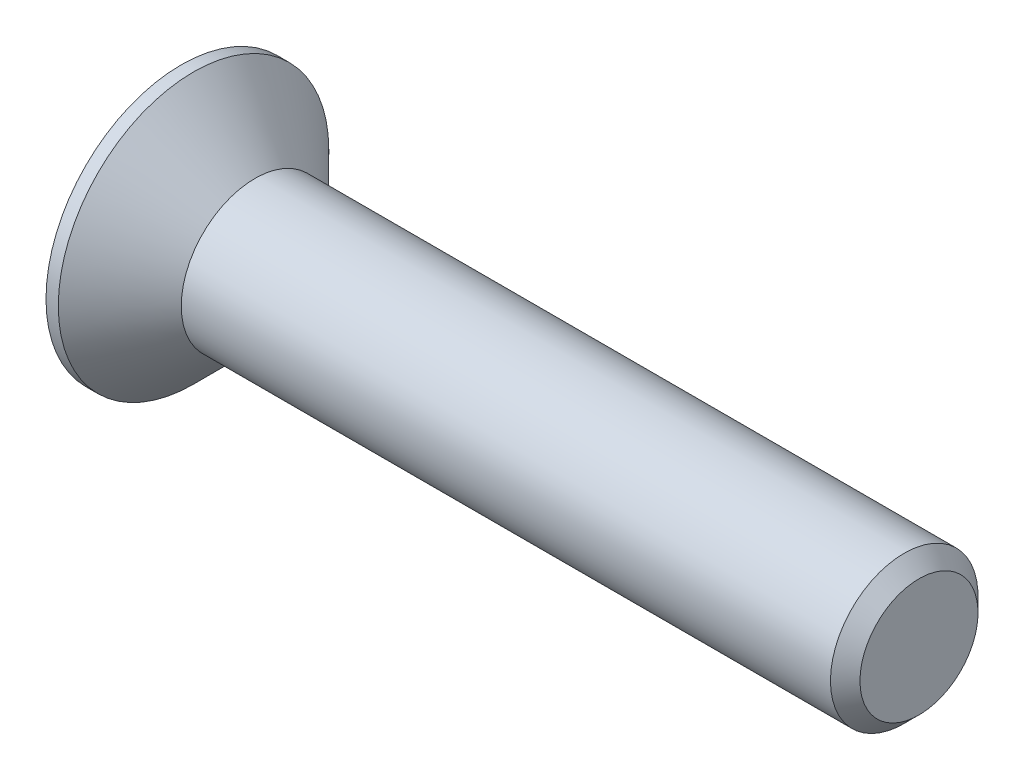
ISO-10303-21;
HEADER;
FILE_DESCRIPTION(('STEP AP214'),'2;1');
FILE_NAME('part.step','',(''),(''),'','','');
FILE_SCHEMA(('AUTOMOTIVE_DESIGN { 1 0 10303 214 1 1 1 1 }'));
ENDSEC;
DATA;
#1=APPLICATION_CONTEXT('core data for automotive mechanical design processes');
#2=APPLICATION_PROTOCOL_DEFINITION('international standard','automotive_design',2000,#1);
#3=PRODUCT_CONTEXT('',#1,'mechanical');
#4=PRODUCT('Part','Part','',(#3));
#5=PRODUCT_RELATED_PRODUCT_CATEGORY('part','',(#4));
#6=PRODUCT_DEFINITION_FORMATION('','',#4);
#7=PRODUCT_DEFINITION_CONTEXT('part definition',#1,'design');
#8=PRODUCT_DEFINITION('design','',#6,#7);
#9=PRODUCT_DEFINITION_SHAPE('','',#8);
#10=(LENGTH_UNIT() NAMED_UNIT(*) SI_UNIT(.MILLI.,.METRE.));
#11=(NAMED_UNIT(*) PLANE_ANGLE_UNIT() SI_UNIT($,.RADIAN.));
#12=(NAMED_UNIT(*) SI_UNIT($,.STERADIAN.) SOLID_ANGLE_UNIT());
#13=UNCERTAINTY_MEASURE_WITH_UNIT(LENGTH_MEASURE(1.E-05),#10,'distance_accuracy_value','');
#14=(GEOMETRIC_REPRESENTATION_CONTEXT(3) GLOBAL_UNCERTAINTY_ASSIGNED_CONTEXT((#13)) GLOBAL_UNIT_ASSIGNED_CONTEXT((#10,
#11,#12)) REPRESENTATION_CONTEXT('',''));
#15=CARTESIAN_POINT('',(0.,0.,0.));
#16=DIRECTION('',(0.,0.,1.));
#17=DIRECTION('',(1.,0.,0.));
#18=AXIS2_PLACEMENT_3D('',#15,#16,#17);
#19=CARTESIAN_POINT('',(0.,0.,0.));
#20=DIRECTION('',(-1.,0.,0.));
#21=DIRECTION('',(0.,0.,1.));
#22=AXIS2_PLACEMENT_3D('',#19,#20,#21);
#23=CONICAL_SURFACE('',#22,3.,0.78539816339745);
#24=CARTESIAN_POINT('',(-2.49999999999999,0.,0.));
#25=DIRECTION('',(-1.,0.,0.));
#26=DIRECTION('',(0.,0.,1.));
#27=AXIS2_PLACEMENT_3D('',#24,#25,#26);
#28=CIRCLE('',#27,5.5);
#29=CARTESIAN_POINT('',(-2.49999999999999,0.,5.5));
#30=VERTEX_POINT('',#29);
#31=EDGE_CURVE('E189',#30,#30,#28,.T.);
#32=ORIENTED_EDGE('',*,*,#31,.F.);
#33=EDGE_LOOP('',(#32));
#34=FACE_BOUND('',#33,.T.);
#35=CARTESIAN_POINT('',(0.,0.,0.));
#36=DIRECTION('',(-1.,0.,0.));
#37=DIRECTION('',(0.,0.,1.));
#38=AXIS2_PLACEMENT_3D('',#35,#36,#37);
#39=CIRCLE('',#38,3.);
#40=CARTESIAN_POINT('',(0.,0.,3.));
#41=VERTEX_POINT('',#40);
#42=EDGE_CURVE('E212',#41,#41,#39,.T.);
#43=ORIENTED_EDGE('',*,*,#42,.T.);
#44=EDGE_LOOP('',(#43));
#45=FACE_BOUND('',#44,.T.);
#46=ADVANCED_FACE('F33',(#34,#45),#23,.T.);
#47=CARTESIAN_POINT('',(-3.,0.,0.));
#48=DIRECTION('',(-1.,0.,0.));
#49=DIRECTION('',(0.,0.,1.));
#50=AXIS2_PLACEMENT_3D('',#47,#48,#49);
#51=CYLINDRICAL_SURFACE('',#50,3.);
#52=CARTESIAN_POINT('',(26.4,0.,0.));
#53=DIRECTION('',(-1.,0.,0.));
#54=DIRECTION('',(0.,0.,1.));
#55=AXIS2_PLACEMENT_3D('',#52,#53,#54);
#56=CIRCLE('',#55,3.);
#57=CARTESIAN_POINT('',(26.4,0.,3.));
#58=VERTEX_POINT('',#57);
#59=EDGE_CURVE('E41',#58,#58,#56,.T.);
#60=ORIENTED_EDGE('',*,*,#59,.T.);
#61=EDGE_LOOP('',(#60));
#62=FACE_BOUND('',#61,.T.);
#63=ORIENTED_EDGE('',*,*,#42,.F.);
#64=EDGE_LOOP('',(#63));
#65=FACE_BOUND('',#64,.T.);
#66=ADVANCED_FACE('F217',(#62,#65),#51,.T.);
#67=CARTESIAN_POINT('',(27.,0.,0.));
#68=DIRECTION('',(-1.,0.,0.));
#69=DIRECTION('',(0.,0.,1.));
#70=AXIS2_PLACEMENT_3D('',#67,#68,#69);
#71=PLANE('',#70);
#72=CARTESIAN_POINT('',(27.,0.,0.));
#73=DIRECTION('',(-1.,0.,0.));
#74=DIRECTION('',(0.,0.,1.));
#75=AXIS2_PLACEMENT_3D('',#72,#73,#74);
#76=CIRCLE('',#75,2.4);
#77=CARTESIAN_POINT('',(27.,0.,2.4));
#78=VERTEX_POINT('',#77);
#79=EDGE_CURVE('E11',#78,#78,#76,.F.);
#80=ORIENTED_EDGE('',*,*,#79,.T.);
#81=EDGE_LOOP('',(#80));
#82=FACE_BOUND('',#81,.T.);
#83=ADVANCED_FACE('F239',(#82),#71,.F.);
#84=CARTESIAN_POINT('',(-3.,5.5,0.));
#85=DIRECTION('',(1.,0.,0.));
#86=DIRECTION('',(0.,0.,-1.));
#87=AXIS2_PLACEMENT_3D('',#84,#85,#86);
#88=PLANE('',#87);
#89=DIRECTION('',(0.,0.,-1.));
#90=VECTOR('',#89,1.);
#91=CARTESIAN_POINT('',(-3.,0.825,-3.3));
#92=LINE('',#91,#90);
#93=CARTESIAN_POINT('',(-3.,0.825,-0.825));
#94=VERTEX_POINT('',#93);
#95=CARTESIAN_POINT('',(-3.,0.825,-3.3));
#96=VERTEX_POINT('',#95);
#97=EDGE_CURVE('E158',#94,#96,#92,.T.);
#98=ORIENTED_EDGE('',*,*,#97,.F.);
#99=DIRECTION('',(0.,-1.,0.));
#100=VECTOR('',#99,1.);
#101=CARTESIAN_POINT('',(-3.,0.825,-0.825));
#102=LINE('',#101,#100);
#103=CARTESIAN_POINT('',(-3.,3.3,-0.825));
#104=VERTEX_POINT('',#103);
#105=EDGE_CURVE('E48',#104,#94,#102,.T.);
#106=ORIENTED_EDGE('',*,*,#105,.F.);
#107=DIRECTION('',(0.,0.,-1.));
#108=VECTOR('',#107,1.);
#109=CARTESIAN_POINT('',(-3.,3.3,-0.825));
#110=LINE('',#109,#108);
#111=CARTESIAN_POINT('',(-3.,3.3,0.825));
#112=VERTEX_POINT('',#111);
#113=EDGE_CURVE('E185',#112,#104,#110,.T.);
#114=ORIENTED_EDGE('',*,*,#113,.F.);
#115=DIRECTION('',(0.,1.,0.));
#116=VECTOR('',#115,1.);
#117=CARTESIAN_POINT('',(-3.,3.3,0.825));
#118=LINE('',#117,#116);
#119=CARTESIAN_POINT('',(-3.,0.825,0.825));
#120=VERTEX_POINT('',#119);
#121=EDGE_CURVE('E183',#120,#112,#118,.T.);
#122=ORIENTED_EDGE('',*,*,#121,.F.);
#123=DIRECTION('',(0.,0.,-1.));
#124=VECTOR('',#123,1.);
#125=CARTESIAN_POINT('',(-3.,0.825,0.825));
#126=LINE('',#125,#124);
#127=CARTESIAN_POINT('',(-3.,0.825,3.3));
#128=VERTEX_POINT('',#127);
#129=EDGE_CURVE('E132',#128,#120,#126,.T.);
#130=ORIENTED_EDGE('',*,*,#129,.F.);
#131=DIRECTION('',(0.,1.,0.));
#132=VECTOR('',#131,1.);
#133=CARTESIAN_POINT('',(-3.,0.825,3.3));
#134=LINE('',#133,#132);
#135=CARTESIAN_POINT('',(-3.,-0.825,3.3));
#136=VERTEX_POINT('',#135);
#137=EDGE_CURVE('E179',#136,#128,#134,.T.);
#138=ORIENTED_EDGE('',*,*,#137,.F.);
#139=DIRECTION('',(0.,0.,1.));
#140=VECTOR('',#139,1.);
#141=CARTESIAN_POINT('',(-3.,-0.825,3.3));
#142=LINE('',#141,#140);
#143=CARTESIAN_POINT('',(-3.,-0.825,0.825));
#144=VERTEX_POINT('',#143);
#145=EDGE_CURVE('E176',#144,#136,#142,.T.);
#146=ORIENTED_EDGE('',*,*,#145,.F.);
#147=DIRECTION('',(0.,1.,0.));
#148=VECTOR('',#147,1.);
#149=CARTESIAN_POINT('',(-3.,-0.825,0.825));
#150=LINE('',#149,#148);
#151=CARTESIAN_POINT('',(-3.,-3.3,0.825));
#152=VERTEX_POINT('',#151);
#153=EDGE_CURVE('E173',#152,#144,#150,.T.);
#154=ORIENTED_EDGE('',*,*,#153,.F.);
#155=DIRECTION('',(0.,0.,1.));
#156=VECTOR('',#155,1.);
#157=CARTESIAN_POINT('',(-3.,-3.3,0.825));
#158=LINE('',#157,#156);
#159=CARTESIAN_POINT('',(-3.,-3.3,-0.825));
#160=VERTEX_POINT('',#159);
#161=EDGE_CURVE('E170',#160,#152,#158,.T.);
#162=ORIENTED_EDGE('',*,*,#161,.F.);
#163=DIRECTION('',(0.,-1.,0.));
#164=VECTOR('',#163,1.);
#165=CARTESIAN_POINT('',(-3.,-3.3,-0.825));
#166=LINE('',#165,#164);
#167=CARTESIAN_POINT('',(-3.,-0.825,-0.825));
#168=VERTEX_POINT('',#167);
#169=EDGE_CURVE('E167',#168,#160,#166,.T.);
#170=ORIENTED_EDGE('',*,*,#169,.F.);
#171=DIRECTION('',(0.,0.,1.));
#172=VECTOR('',#171,1.);
#173=CARTESIAN_POINT('',(-3.,-0.825,-0.825));
#174=LINE('',#173,#172);
#175=CARTESIAN_POINT('',(-3.,-0.825,-3.3));
#176=VERTEX_POINT('',#175);
#177=EDGE_CURVE('E164',#176,#168,#174,.T.);
#178=ORIENTED_EDGE('',*,*,#177,.F.);
#179=DIRECTION('',(0.,-1.,0.));
#180=VECTOR('',#179,1.);
#181=CARTESIAN_POINT('',(-3.,-0.825,-3.3));
#182=LINE('',#181,#180);
#183=EDGE_CURVE('E161',#96,#176,#182,.T.);
#184=ORIENTED_EDGE('',*,*,#183,.F.);
#185=EDGE_LOOP('',(#98,#106,#114,#122,#130,#138,#146,#154,#162,#170,#178,#184));
#186=FACE_BOUND('',#185,.T.);
#187=CARTESIAN_POINT('',(-3.,0.,0.));
#188=DIRECTION('',(-1.,0.,0.));
#189=DIRECTION('',(0.,0.,1.));
#190=AXIS2_PLACEMENT_3D('',#187,#188,#189);
#191=CIRCLE('',#190,5.5);
#192=CARTESIAN_POINT('',(-3.,0.,5.5));
#193=VERTEX_POINT('',#192);
#194=EDGE_CURVE('E209',#193,#193,#191,.T.);
#195=ORIENTED_EDGE('',*,*,#194,.T.);
#196=EDGE_LOOP('',(#195));
#197=FACE_BOUND('',#196,.T.);
#198=ADVANCED_FACE('F230',(#186,#197),#88,.F.);
#199=CARTESIAN_POINT('',(-3.,0.,0.));
#200=DIRECTION('',(-1.,0.,0.));
#201=DIRECTION('',(0.,0.,1.));
#202=AXIS2_PLACEMENT_3D('',#199,#200,#201);
#203=CYLINDRICAL_SURFACE('',#202,5.5);
#204=ORIENTED_EDGE('',*,*,#194,.F.);
#205=EDGE_LOOP('',(#204));
#206=FACE_BOUND('',#205,.T.);
#207=ORIENTED_EDGE('',*,*,#31,.T.);
#208=EDGE_LOOP('',(#207));
#209=FACE_BOUND('',#208,.T.);
#210=ADVANCED_FACE('F222',(#206,#209),#203,.T.);
#211=CARTESIAN_POINT('',(26.4,0.,0.));
#212=DIRECTION('',(-1.,0.,0.));
#213=DIRECTION('',(0.,0.,1.));
#214=AXIS2_PLACEMENT_3D('',#211,#212,#213);
#215=CONICAL_SURFACE('',#214,3.,0.785398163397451);
#216=ORIENTED_EDGE('',*,*,#79,.F.);
#217=EDGE_LOOP('',(#216));
#218=FACE_BOUND('',#217,.T.);
#219=ORIENTED_EDGE('',*,*,#59,.F.);
#220=EDGE_LOOP('',(#219));
#221=FACE_BOUND('',#220,.T.);
#222=ADVANCED_FACE('F35',(#218,#221),#215,.T.);
#223=CARTESIAN_POINT('',(-0.5,0.825,-0.825));
#224=DIRECTION('',(0.,0.,-1.));
#225=DIRECTION('',(-1.,0.,0.));
#226=AXIS2_PLACEMENT_3D('',#223,#224,#225);
#227=PLANE('',#226);
#228=ORIENTED_EDGE('',*,*,#105,.T.);
#229=DIRECTION('',(-1.,0.,0.));
#230=VECTOR('',#229,1.);
#231=CARTESIAN_POINT('',(-0.5,0.825,-0.825));
#232=LINE('',#231,#230);
#233=CARTESIAN_POINT('',(-0.5,0.825,-0.825));
#234=VERTEX_POINT('',#233);
#235=EDGE_CURVE('E96',#234,#94,#232,.T.);
#236=ORIENTED_EDGE('',*,*,#235,.F.);
#237=DIRECTION('',(0.,-1.,0.));
#238=VECTOR('',#237,1.);
#239=CARTESIAN_POINT('',(-0.5,0.825,-0.825));
#240=LINE('',#239,#238);
#241=CARTESIAN_POINT('',(-0.5,3.3,-0.825));
#242=VERTEX_POINT('',#241);
#243=EDGE_CURVE('E187',#242,#234,#240,.T.);
#244=ORIENTED_EDGE('',*,*,#243,.F.);
#245=DIRECTION('',(-1.,0.,0.));
#246=VECTOR('',#245,1.);
#247=CARTESIAN_POINT('',(-0.5,3.3,-0.825));
#248=LINE('',#247,#246);
#249=EDGE_CURVE('E56',#242,#104,#248,.T.);
#250=ORIENTED_EDGE('',*,*,#249,.T.);
#251=EDGE_LOOP('',(#228,#236,#244,#250));
#252=FACE_BOUND('',#251,.T.);
#253=ADVANCED_FACE('F221',(#252),#227,.F.);
#254=CARTESIAN_POINT('',(-0.5,3.3,-0.825));
#255=DIRECTION('',(0.,1.,0.));
#256=DIRECTION('',(-1.,0.,0.));
#257=AXIS2_PLACEMENT_3D('',#254,#255,#256);
#258=PLANE('',#257);
#259=ORIENTED_EDGE('',*,*,#113,.T.);
#260=ORIENTED_EDGE('',*,*,#249,.F.);
#261=DIRECTION('',(0.,0.,-1.));
#262=VECTOR('',#261,1.);
#263=CARTESIAN_POINT('',(-0.5,3.3,-0.825));
#264=LINE('',#263,#262);
#265=CARTESIAN_POINT('',(-0.5,3.3,0.825));
#266=VERTEX_POINT('',#265);
#267=EDGE_CURVE('E144',#266,#242,#264,.T.);
#268=ORIENTED_EDGE('',*,*,#267,.F.);
#269=DIRECTION('',(-1.,0.,0.));
#270=VECTOR('',#269,1.);
#271=CARTESIAN_POINT('',(-0.5,3.3,0.825));
#272=LINE('',#271,#270);
#273=EDGE_CURVE('E136',#266,#112,#272,.T.);
#274=ORIENTED_EDGE('',*,*,#273,.T.);
#275=EDGE_LOOP('',(#259,#260,#268,#274));
#276=FACE_BOUND('',#275,.T.);
#277=ADVANCED_FACE('F228',(#276),#258,.F.);
#278=CARTESIAN_POINT('',(-0.5,3.3,0.825));
#279=DIRECTION('',(0.,0.,1.));
#280=DIRECTION('',(1.,0.,0.));
#281=AXIS2_PLACEMENT_3D('',#278,#279,#280);
#282=PLANE('',#281);
#283=ORIENTED_EDGE('',*,*,#121,.T.);
#284=ORIENTED_EDGE('',*,*,#273,.F.);
#285=DIRECTION('',(0.,1.,0.));
#286=VECTOR('',#285,1.);
#287=CARTESIAN_POINT('',(-0.5,3.3,0.825));
#288=LINE('',#287,#286);
#289=CARTESIAN_POINT('',(-0.5,0.825,0.825));
#290=VERTEX_POINT('',#289);
#291=EDGE_CURVE('E140',#290,#266,#288,.T.);
#292=ORIENTED_EDGE('',*,*,#291,.F.);
#293=DIRECTION('',(-1.,0.,0.));
#294=VECTOR('',#293,1.);
#295=CARTESIAN_POINT('',(-0.5,0.825,0.825));
#296=LINE('',#295,#294);
#297=EDGE_CURVE('E125',#290,#120,#296,.T.);
#298=ORIENTED_EDGE('',*,*,#297,.T.);
#299=EDGE_LOOP('',(#283,#284,#292,#298));
#300=FACE_BOUND('',#299,.T.);
#301=ADVANCED_FACE('F141',(#300),#282,.F.);
#302=CARTESIAN_POINT('',(-0.5,0.825,0.825));
#303=DIRECTION('',(0.,1.,0.));
#304=DIRECTION('',(-1.,0.,0.));
#305=AXIS2_PLACEMENT_3D('',#302,#303,#304);
#306=PLANE('',#305);
#307=ORIENTED_EDGE('',*,*,#129,.T.);
#308=ORIENTED_EDGE('',*,*,#297,.F.);
#309=DIRECTION('',(0.,0.,-1.));
#310=VECTOR('',#309,1.);
#311=CARTESIAN_POINT('',(-0.5,0.825,0.825));
#312=LINE('',#311,#310);
#313=CARTESIAN_POINT('',(-0.5,0.825,3.3));
#314=VERTEX_POINT('',#313);
#315=EDGE_CURVE('E129',#314,#290,#312,.T.);
#316=ORIENTED_EDGE('',*,*,#315,.F.);
#317=DIRECTION('',(-1.,0.,0.));
#318=VECTOR('',#317,1.);
#319=CARTESIAN_POINT('',(-0.5,0.825,3.3));
#320=LINE('',#319,#318);
#321=EDGE_CURVE('E137',#314,#128,#320,.T.);
#322=ORIENTED_EDGE('',*,*,#321,.T.);
#323=EDGE_LOOP('',(#307,#308,#316,#322));
#324=FACE_BOUND('',#323,.T.);
#325=ADVANCED_FACE('F127',(#324),#306,.F.);
#326=CARTESIAN_POINT('',(-0.5,0.825,3.3));
#327=DIRECTION('',(0.,0.,1.));
#328=DIRECTION('',(1.,0.,0.));
#329=AXIS2_PLACEMENT_3D('',#326,#327,#328);
#330=PLANE('',#329);
#331=ORIENTED_EDGE('',*,*,#137,.T.);
#332=ORIENTED_EDGE('',*,*,#321,.F.);
#333=DIRECTION('',(0.,1.,0.));
#334=VECTOR('',#333,1.);
#335=CARTESIAN_POINT('',(-0.5,0.825,3.3));
#336=LINE('',#335,#334);
#337=CARTESIAN_POINT('',(-0.5,-0.825,3.3));
#338=VERTEX_POINT('',#337);
#339=EDGE_CURVE('E150',#338,#314,#336,.T.);
#340=ORIENTED_EDGE('',*,*,#339,.F.);
#341=DIRECTION('',(-1.,0.,0.));
#342=VECTOR('',#341,1.);
#343=CARTESIAN_POINT('',(-0.5,-0.825,3.3));
#344=LINE('',#343,#342);
#345=EDGE_CURVE('E192',#338,#136,#344,.T.);
#346=ORIENTED_EDGE('',*,*,#345,.T.);
#347=EDGE_LOOP('',(#331,#332,#340,#346));
#348=FACE_BOUND('',#347,.T.);
#349=ADVANCED_FACE('F277',(#348),#330,.F.);
#350=CARTESIAN_POINT('',(-0.5,-0.825,3.3));
#351=DIRECTION('',(0.,-1.,0.));
#352=DIRECTION('',(1.,0.,0.));
#353=AXIS2_PLACEMENT_3D('',#350,#351,#352);
#354=PLANE('',#353);
#355=ORIENTED_EDGE('',*,*,#145,.T.);
#356=ORIENTED_EDGE('',*,*,#345,.F.);
#357=DIRECTION('',(0.,0.,1.));
#358=VECTOR('',#357,1.);
#359=CARTESIAN_POINT('',(-0.5,-0.825,3.3));
#360=LINE('',#359,#358);
#361=CARTESIAN_POINT('',(-0.5,-0.825,0.825));
#362=VERTEX_POINT('',#361);
#363=EDGE_CURVE('E152',#362,#338,#360,.T.);
#364=ORIENTED_EDGE('',*,*,#363,.F.);
#365=DIRECTION('',(-1.,0.,0.));
#366=VECTOR('',#365,1.);
#367=CARTESIAN_POINT('',(-0.5,-0.825,0.825));
#368=LINE('',#367,#366);
#369=EDGE_CURVE('E194',#362,#144,#368,.T.);
#370=ORIENTED_EDGE('',*,*,#369,.T.);
#371=EDGE_LOOP('',(#355,#356,#364,#370));
#372=FACE_BOUND('',#371,.T.);
#373=ADVANCED_FACE('F273',(#372),#354,.F.);
#374=CARTESIAN_POINT('',(-0.5,-0.825,0.825));
#375=DIRECTION('',(0.,0.,1.));
#376=DIRECTION('',(1.,0.,0.));
#377=AXIS2_PLACEMENT_3D('',#374,#375,#376);
#378=PLANE('',#377);
#379=ORIENTED_EDGE('',*,*,#153,.T.);
#380=ORIENTED_EDGE('',*,*,#369,.F.);
#381=DIRECTION('',(0.,1.,0.));
#382=VECTOR('',#381,1.);
#383=CARTESIAN_POINT('',(-0.5,-0.825,0.825));
#384=LINE('',#383,#382);
#385=CARTESIAN_POINT('',(-0.5,-3.3,0.825));
#386=VERTEX_POINT('',#385);
#387=EDGE_CURVE('E422',#386,#362,#384,.T.);
#388=ORIENTED_EDGE('',*,*,#387,.F.);
#389=DIRECTION('',(-1.,0.,0.));
#390=VECTOR('',#389,1.);
#391=CARTESIAN_POINT('',(-0.5,-3.3,0.825));
#392=LINE('',#391,#390);
#393=EDGE_CURVE('E196',#386,#152,#392,.T.);
#394=ORIENTED_EDGE('',*,*,#393,.T.);
#395=EDGE_LOOP('',(#379,#380,#388,#394));
#396=FACE_BOUND('',#395,.T.);
#397=ADVANCED_FACE('F269',(#396),#378,.F.);
#398=CARTESIAN_POINT('',(-0.5,-3.3,0.825));
#399=DIRECTION('',(0.,-1.,0.));
#400=DIRECTION('',(1.,0.,0.));
#401=AXIS2_PLACEMENT_3D('',#398,#399,#400);
#402=PLANE('',#401);
#403=ORIENTED_EDGE('',*,*,#161,.T.);
#404=ORIENTED_EDGE('',*,*,#393,.F.);
#405=DIRECTION('',(0.,0.,1.));
#406=VECTOR('',#405,1.);
#407=CARTESIAN_POINT('',(-0.5,-3.3,0.825));
#408=LINE('',#407,#406);
#409=CARTESIAN_POINT('',(-0.5,-3.3,-0.825));
#410=VERTEX_POINT('',#409);
#411=EDGE_CURVE('E419',#410,#386,#408,.T.);
#412=ORIENTED_EDGE('',*,*,#411,.F.);
#413=DIRECTION('',(-1.,0.,0.));
#414=VECTOR('',#413,1.);
#415=CARTESIAN_POINT('',(-0.5,-3.3,-0.825));
#416=LINE('',#415,#414);
#417=EDGE_CURVE('E198',#410,#160,#416,.T.);
#418=ORIENTED_EDGE('',*,*,#417,.T.);
#419=EDGE_LOOP('',(#403,#404,#412,#418));
#420=FACE_BOUND('',#419,.T.);
#421=ADVANCED_FACE('F265',(#420),#402,.F.);
#422=CARTESIAN_POINT('',(-0.5,-3.3,-0.825));
#423=DIRECTION('',(0.,0.,-1.));
#424=DIRECTION('',(-1.,0.,0.));
#425=AXIS2_PLACEMENT_3D('',#422,#423,#424);
#426=PLANE('',#425);
#427=ORIENTED_EDGE('',*,*,#169,.T.);
#428=ORIENTED_EDGE('',*,*,#417,.F.);
#429=DIRECTION('',(0.,-1.,0.));
#430=VECTOR('',#429,1.);
#431=CARTESIAN_POINT('',(-0.5,-3.3,-0.825));
#432=LINE('',#431,#430);
#433=CARTESIAN_POINT('',(-0.5,-0.825,-0.825));
#434=VERTEX_POINT('',#433);
#435=EDGE_CURVE('E416',#434,#410,#432,.T.);
#436=ORIENTED_EDGE('',*,*,#435,.F.);
#437=DIRECTION('',(-1.,0.,0.));
#438=VECTOR('',#437,1.);
#439=CARTESIAN_POINT('',(-0.5,-0.825,-0.825));
#440=LINE('',#439,#438);
#441=EDGE_CURVE('E200',#434,#168,#440,.T.);
#442=ORIENTED_EDGE('',*,*,#441,.T.);
#443=EDGE_LOOP('',(#427,#428,#436,#442));
#444=FACE_BOUND('',#443,.T.);
#445=ADVANCED_FACE('F261',(#444),#426,.F.);
#446=CARTESIAN_POINT('',(-0.5,-0.825,-0.825));
#447=DIRECTION('',(0.,-1.,0.));
#448=DIRECTION('',(1.,0.,0.));
#449=AXIS2_PLACEMENT_3D('',#446,#447,#448);
#450=PLANE('',#449);
#451=ORIENTED_EDGE('',*,*,#177,.T.);
#452=ORIENTED_EDGE('',*,*,#441,.F.);
#453=DIRECTION('',(0.,0.,1.));
#454=VECTOR('',#453,1.);
#455=CARTESIAN_POINT('',(-0.5,-0.825,-0.825));
#456=LINE('',#455,#454);
#457=CARTESIAN_POINT('',(-0.5,-0.825,-3.3));
#458=VERTEX_POINT('',#457);
#459=EDGE_CURVE('E413',#458,#434,#456,.T.);
#460=ORIENTED_EDGE('',*,*,#459,.F.);
#461=DIRECTION('',(-1.,0.,0.));
#462=VECTOR('',#461,1.);
#463=CARTESIAN_POINT('',(-0.5,-0.825,-3.3));
#464=LINE('',#463,#462);
#465=EDGE_CURVE('E202',#458,#176,#464,.T.);
#466=ORIENTED_EDGE('',*,*,#465,.T.);
#467=EDGE_LOOP('',(#451,#452,#460,#466));
#468=FACE_BOUND('',#467,.T.);
#469=ADVANCED_FACE('F257',(#468),#450,.F.);
#470=CARTESIAN_POINT('',(-0.5,-0.825,-3.3));
#471=DIRECTION('',(0.,0.,-1.));
#472=DIRECTION('',(-1.,0.,0.));
#473=AXIS2_PLACEMENT_3D('',#470,#471,#472);
#474=PLANE('',#473);
#475=ORIENTED_EDGE('',*,*,#183,.T.);
#476=ORIENTED_EDGE('',*,*,#465,.F.);
#477=DIRECTION('',(0.,-1.,0.));
#478=VECTOR('',#477,1.);
#479=CARTESIAN_POINT('',(-0.5,-0.825,-3.3));
#480=LINE('',#479,#478);
#481=CARTESIAN_POINT('',(-0.5,0.825,-3.3));
#482=VERTEX_POINT('',#481);
#483=EDGE_CURVE('E408',#482,#458,#480,.T.);
#484=ORIENTED_EDGE('',*,*,#483,.F.);
#485=DIRECTION('',(-1.,0.,0.));
#486=VECTOR('',#485,1.);
#487=CARTESIAN_POINT('',(-0.5,0.825,-3.3));
#488=LINE('',#487,#486);
#489=EDGE_CURVE('E204',#482,#96,#488,.T.);
#490=ORIENTED_EDGE('',*,*,#489,.T.);
#491=EDGE_LOOP('',(#475,#476,#484,#490));
#492=FACE_BOUND('',#491,.T.);
#493=ADVANCED_FACE('F253',(#492),#474,.F.);
#494=CARTESIAN_POINT('',(-0.5,0.825,-3.3));
#495=DIRECTION('',(0.,1.,0.));
#496=DIRECTION('',(-1.,0.,0.));
#497=AXIS2_PLACEMENT_3D('',#494,#495,#496);
#498=PLANE('',#497);
#499=ORIENTED_EDGE('',*,*,#97,.T.);
#500=ORIENTED_EDGE('',*,*,#489,.F.);
#501=DIRECTION('',(0.,0.,-1.));
#502=VECTOR('',#501,1.);
#503=CARTESIAN_POINT('',(-0.5,0.825,-3.3));
#504=LINE('',#503,#502);
#505=EDGE_CURVE('E406',#234,#482,#504,.T.);
#506=ORIENTED_EDGE('',*,*,#505,.F.);
#507=ORIENTED_EDGE('',*,*,#235,.T.);
#508=EDGE_LOOP('',(#499,#500,#506,#507));
#509=FACE_BOUND('',#508,.T.);
#510=ADVANCED_FACE('F250',(#509),#498,.F.);
#511=CARTESIAN_POINT('',(-0.5,0.,0.));
#512=DIRECTION('',(1.,0.,0.));
#513=DIRECTION('',(0.,0.,-1.));
#514=AXIS2_PLACEMENT_3D('',#511,#512,#513);
#515=PLANE('',#514);
#516=ORIENTED_EDGE('',*,*,#243,.T.);
#517=ORIENTED_EDGE('',*,*,#505,.T.);
#518=ORIENTED_EDGE('',*,*,#483,.T.);
#519=ORIENTED_EDGE('',*,*,#459,.T.);
#520=ORIENTED_EDGE('',*,*,#435,.T.);
#521=ORIENTED_EDGE('',*,*,#411,.T.);
#522=ORIENTED_EDGE('',*,*,#387,.T.);
#523=ORIENTED_EDGE('',*,*,#363,.T.);
#524=ORIENTED_EDGE('',*,*,#339,.T.);
#525=ORIENTED_EDGE('',*,*,#315,.T.);
#526=ORIENTED_EDGE('',*,*,#291,.T.);
#527=ORIENTED_EDGE('',*,*,#267,.T.);
#528=EDGE_LOOP('',(#516,#517,#518,#519,#520,#521,#522,#523,#524,#525,#526,#527));
#529=FACE_BOUND('',#528,.T.);
#530=ADVANCED_FACE('F147',(#529),#515,.F.);
#531=CLOSED_SHELL('',(#46,#66,#83,#198,#210,#222,#253,#277,#301,#325,#349,#373,#397,#421,#445,
#469,#493,#510,#530));
#532=MANIFOLD_SOLID_BREP('B2',#531);
#533=ADVANCED_BREP_SHAPE_REPRESENTATION('',(#18,#532),#14);
#534=SHAPE_DEFINITION_REPRESENTATION(#9,#533);
ENDSEC;
END-ISO-10303-21;
